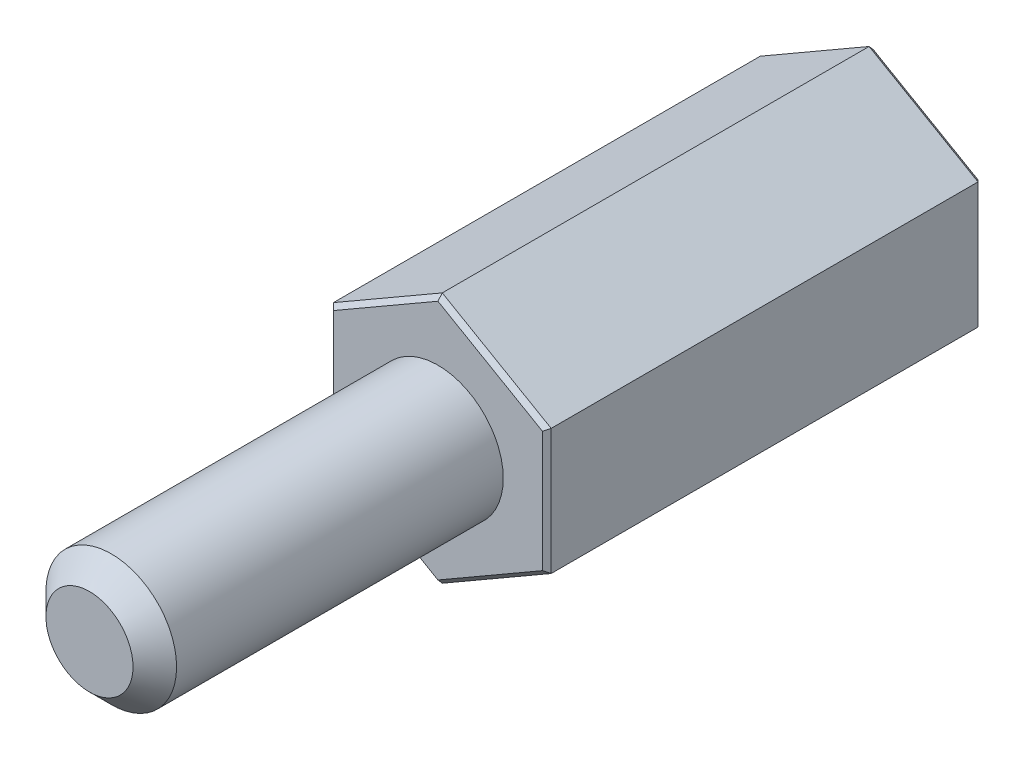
ISO-10303-21;
HEADER;
FILE_DESCRIPTION(('STEP AP214'),'2;1');
FILE_NAME('part.step','',(''),(''),'','','');
FILE_SCHEMA(('AUTOMOTIVE_DESIGN { 1 0 10303 214 1 1 1 1 }'));
ENDSEC;
DATA;
#1=APPLICATION_CONTEXT('core data for automotive mechanical design processes');
#2=APPLICATION_PROTOCOL_DEFINITION('international standard','automotive_design',2000,#1);
#3=PRODUCT_CONTEXT('',#1,'mechanical');
#4=PRODUCT('Part','Part','',(#3));
#5=PRODUCT_RELATED_PRODUCT_CATEGORY('part','',(#4));
#6=PRODUCT_DEFINITION_FORMATION('','',#4);
#7=PRODUCT_DEFINITION_CONTEXT('part definition',#1,'design');
#8=PRODUCT_DEFINITION('design','',#6,#7);
#9=PRODUCT_DEFINITION_SHAPE('','',#8);
#10=(LENGTH_UNIT() NAMED_UNIT(*) SI_UNIT(.MILLI.,.METRE.));
#11=(NAMED_UNIT(*) PLANE_ANGLE_UNIT() SI_UNIT($,.RADIAN.));
#12=(NAMED_UNIT(*) SI_UNIT($,.STERADIAN.) SOLID_ANGLE_UNIT());
#13=UNCERTAINTY_MEASURE_WITH_UNIT(LENGTH_MEASURE(1.E-05),#10,'distance_accuracy_value','');
#14=(GEOMETRIC_REPRESENTATION_CONTEXT(3) GLOBAL_UNCERTAINTY_ASSIGNED_CONTEXT((#13)) GLOBAL_UNIT_ASSIGNED_CONTEXT((#10,
#11,#12)) REPRESENTATION_CONTEXT('',''));
#15=CARTESIAN_POINT('',(0.,0.,0.));
#16=DIRECTION('',(0.,0.,1.));
#17=DIRECTION('',(1.,0.,0.));
#18=AXIS2_PLACEMENT_3D('',#15,#16,#17);
#19=CARTESIAN_POINT('',(2.5,1.44337567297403,10.));
#20=DIRECTION('',(0.,0.,1.));
#21=DIRECTION('',(1.,0.,0.));
#22=AXIS2_PLACEMENT_3D('',#19,#20,#21);
#23=PLANE('',#22);
#24=DIRECTION('',(-0.866025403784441,-0.499999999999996,0.));
#25=VECTOR('',#24,1.);
#26=CARTESIAN_POINT('',(-2.44999999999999,1.3567731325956,10.));
#27=LINE('',#26,#25);
#28=CARTESIAN_POINT('',(0.,2.77128129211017,10.));
#29=VERTEX_POINT('',#28);
#30=CARTESIAN_POINT('',(-2.39999999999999,1.38564064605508,10.));
#31=VERTEX_POINT('',#30);
#32=EDGE_CURVE('E268',#29,#31,#27,.T.);
#33=ORIENTED_EDGE('',*,*,#32,.T.);
#34=DIRECTION('',(0.,-1.,0.));
#35=VECTOR('',#34,1.);
#36=CARTESIAN_POINT('',(-2.40000000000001,-1.44337567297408,10.));
#37=LINE('',#36,#35);
#38=CARTESIAN_POINT('',(-2.40000000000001,-1.38564064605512,10.));
#39=VERTEX_POINT('',#38);
#40=EDGE_CURVE('E47',#31,#39,#37,.T.);
#41=ORIENTED_EDGE('',*,*,#40,.T.);
#42=DIRECTION('',(0.866025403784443,-0.499999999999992,0.));
#43=VECTOR('',#42,1.);
#44=CARTESIAN_POINT('',(0.0500000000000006,-2.80014880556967,10.));
#45=LINE('',#44,#43);
#46=CARTESIAN_POINT('',(0.,-2.77128129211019,10.));
#47=VERTEX_POINT('',#46);
#48=EDGE_CURVE('E272',#39,#47,#45,.T.);
#49=ORIENTED_EDGE('',*,*,#48,.T.);
#50=DIRECTION('',(0.866025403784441,0.499999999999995,0.));
#51=VECTOR('',#50,1.);
#52=CARTESIAN_POINT('',(2.45,-1.35677313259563,10.));
#53=LINE('',#52,#51);
#54=CARTESIAN_POINT('',(2.4,-1.38564064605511,10.));
#55=VERTEX_POINT('',#54);
#56=EDGE_CURVE('E270',#47,#55,#53,.T.);
#57=ORIENTED_EDGE('',*,*,#56,.T.);
#58=DIRECTION('',(0.,1.,0.));
#59=VECTOR('',#58,1.);
#60=CARTESIAN_POINT('',(2.4,1.44337567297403,10.));
#61=LINE('',#60,#59);
#62=CARTESIAN_POINT('',(2.4,1.38564064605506,10.));
#63=VERTEX_POINT('',#62);
#64=EDGE_CURVE('E237',#55,#63,#61,.T.);
#65=ORIENTED_EDGE('',*,*,#64,.T.);
#66=DIRECTION('',(-0.866025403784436,0.500000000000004,0.));
#67=VECTOR('',#66,1.);
#68=CARTESIAN_POINT('',(-0.0499999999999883,2.80014880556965,10.));
#69=LINE('',#68,#67);
#70=EDGE_CURVE('E266',#63,#29,#69,.T.);
#71=ORIENTED_EDGE('',*,*,#70,.T.);
#72=EDGE_LOOP('',(#33,#41,#49,#57,#65,#71));
#73=FACE_BOUND('',#72,.T.);
#74=CARTESIAN_POINT('',(0.,0.,10.));
#75=DIRECTION('',(0.,0.,1.));
#76=DIRECTION('',(1.,0.,0.));
#77=AXIS2_PLACEMENT_3D('',#74,#75,#76);
#78=CIRCLE('',#77,1.5);
#79=CARTESIAN_POINT('',(1.5,0.,10.));
#80=VERTEX_POINT('',#79);
#81=EDGE_CURVE('E292',#80,#80,#78,.T.);
#82=ORIENTED_EDGE('',*,*,#81,.F.);
#83=EDGE_LOOP('',(#82));
#84=FACE_BOUND('',#83,.T.);
#85=ADVANCED_FACE('F38',(#73,#84),#23,.T.);
#86=CARTESIAN_POINT('',(0.,2.8867513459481,10.));
#87=DIRECTION('',(-0.500000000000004,-0.866025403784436,0.));
#88=DIRECTION('',(0.866025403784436,-0.500000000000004,0.));
#89=AXIS2_PLACEMENT_3D('',#86,#87,#88);
#90=PLANE('',#89);
#91=DIRECTION('',(0.,0.,-1.));
#92=VECTOR('',#91,1.);
#93=CARTESIAN_POINT('',(2.5,1.44337567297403,10.));
#94=LINE('',#93,#92);
#95=CARTESIAN_POINT('',(2.5,1.44337567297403,9.9));
#96=VERTEX_POINT('',#95);
#97=CARTESIAN_POINT('',(2.5,1.44337567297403,0.100000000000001));
#98=VERTEX_POINT('',#97);
#99=EDGE_CURVE('E347',#96,#98,#94,.T.);
#100=ORIENTED_EDGE('',*,*,#99,.T.);
#101=DIRECTION('',(-0.866025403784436,0.500000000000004,0.));
#102=VECTOR('',#101,1.);
#103=CARTESIAN_POINT('',(0.,2.8867513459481,0.100000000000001));
#104=LINE('',#103,#102);
#105=CARTESIAN_POINT('',(0.,2.8867513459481,0.100000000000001));
#106=VERTEX_POINT('',#105);
#107=EDGE_CURVE('E260',#98,#106,#104,.T.);
#108=ORIENTED_EDGE('',*,*,#107,.T.);
#109=DIRECTION('',(0.,0.,-1.));
#110=VECTOR('',#109,1.);
#111=CARTESIAN_POINT('',(0.,2.8867513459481,10.));
#112=LINE('',#111,#110);
#113=CARTESIAN_POINT('',(0.,2.8867513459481,9.9));
#114=VERTEX_POINT('',#113);
#115=EDGE_CURVE('E334',#114,#106,#112,.T.);
#116=ORIENTED_EDGE('',*,*,#115,.F.);
#117=DIRECTION('',(0.866025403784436,-0.500000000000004,0.));
#118=VECTOR('',#117,1.);
#119=CARTESIAN_POINT('',(2.5,1.44337567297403,9.9));
#120=LINE('',#119,#118);
#121=EDGE_CURVE('E253',#114,#96,#120,.T.);
#122=ORIENTED_EDGE('',*,*,#121,.T.);
#123=EDGE_LOOP('',(#100,#108,#116,#122));
#124=FACE_BOUND('',#123,.T.);
#125=ADVANCED_FACE('F140',(#124),#90,.F.);
#126=CARTESIAN_POINT('',(0.,2.8867513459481,10.));
#127=DIRECTION('',(0.499999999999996,-0.866025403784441,0.));
#128=DIRECTION('',(0.866025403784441,0.499999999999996,0.));
#129=AXIS2_PLACEMENT_3D('',#126,#127,#128);
#130=PLANE('',#129);
#131=ORIENTED_EDGE('',*,*,#115,.T.);
#132=DIRECTION('',(-0.866025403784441,-0.499999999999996,0.));
#133=VECTOR('',#132,1.);
#134=CARTESIAN_POINT('',(0.,2.8867513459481,0.100000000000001));
#135=LINE('',#134,#133);
#136=CARTESIAN_POINT('',(-2.49999999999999,1.44337567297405,0.100000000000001));
#137=VERTEX_POINT('',#136);
#138=EDGE_CURVE('E323',#106,#137,#135,.T.);
#139=ORIENTED_EDGE('',*,*,#138,.T.);
#140=DIRECTION('',(0.,0.,-1.));
#141=VECTOR('',#140,1.);
#142=CARTESIAN_POINT('',(-2.49999999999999,1.44337567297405,10.));
#143=LINE('',#142,#141);
#144=CARTESIAN_POINT('',(-2.49999999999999,1.44337567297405,9.9));
#145=VERTEX_POINT('',#144);
#146=EDGE_CURVE('E337',#145,#137,#143,.T.);
#147=ORIENTED_EDGE('',*,*,#146,.F.);
#148=DIRECTION('',(0.866025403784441,0.499999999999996,0.));
#149=VECTOR('',#148,1.);
#150=CARTESIAN_POINT('',(0.,2.8867513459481,9.9));
#151=LINE('',#150,#149);
#152=EDGE_CURVE('E326',#145,#114,#151,.T.);
#153=ORIENTED_EDGE('',*,*,#152,.T.);
#154=EDGE_LOOP('',(#131,#139,#147,#153));
#155=FACE_BOUND('',#154,.T.);
#156=ADVANCED_FACE('F146',(#155),#130,.F.);
#157=CARTESIAN_POINT('',(-2.50000000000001,-1.44337567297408,10.));
#158=DIRECTION('',(1.,0.,0.));
#159=DIRECTION('',(0.,1.,0.));
#160=AXIS2_PLACEMENT_3D('',#157,#158,#159);
#161=PLANE('',#160);
#162=ORIENTED_EDGE('',*,*,#146,.T.);
#163=DIRECTION('',(0.,-1.,0.));
#164=VECTOR('',#163,1.);
#165=CARTESIAN_POINT('',(-2.50000000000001,-1.44337567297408,0.100000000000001));
#166=LINE('',#165,#164);
#167=CARTESIAN_POINT('',(-2.50000000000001,-1.44337567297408,0.100000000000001));
#168=VERTEX_POINT('',#167);
#169=EDGE_CURVE('E304',#137,#168,#166,.T.);
#170=ORIENTED_EDGE('',*,*,#169,.T.);
#171=DIRECTION('',(0.,0.,-1.));
#172=VECTOR('',#171,1.);
#173=CARTESIAN_POINT('',(-2.50000000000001,-1.44337567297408,10.));
#174=LINE('',#173,#172);
#175=CARTESIAN_POINT('',(-2.50000000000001,-1.44337567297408,9.9));
#176=VERTEX_POINT('',#175);
#177=EDGE_CURVE('E340',#176,#168,#174,.T.);
#178=ORIENTED_EDGE('',*,*,#177,.F.);
#179=DIRECTION('',(0.,1.,0.));
#180=VECTOR('',#179,1.);
#181=CARTESIAN_POINT('',(-2.49999999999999,1.44337567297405,9.9));
#182=LINE('',#181,#180);
#183=EDGE_CURVE('E305',#176,#145,#182,.T.);
#184=ORIENTED_EDGE('',*,*,#183,.T.);
#185=EDGE_LOOP('',(#162,#170,#178,#184));
#186=FACE_BOUND('',#185,.T.);
#187=ADVANCED_FACE('F169',(#186),#161,.F.);
#188=CARTESIAN_POINT('',(0.,-2.88675134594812,10.));
#189=DIRECTION('',(0.499999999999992,0.866025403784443,0.));
#190=DIRECTION('',(-0.866025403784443,0.499999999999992,0.));
#191=AXIS2_PLACEMENT_3D('',#188,#189,#190);
#192=PLANE('',#191);
#193=ORIENTED_EDGE('',*,*,#177,.T.);
#194=DIRECTION('',(0.866025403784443,-0.499999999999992,0.));
#195=VECTOR('',#194,1.);
#196=CARTESIAN_POINT('',(0.,-2.88675134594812,0.100000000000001));
#197=LINE('',#196,#195);
#198=CARTESIAN_POINT('',(0.,-2.88675134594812,0.100000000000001));
#199=VERTEX_POINT('',#198);
#200=EDGE_CURVE('E251',#168,#199,#197,.T.);
#201=ORIENTED_EDGE('',*,*,#200,.T.);
#202=DIRECTION('',(0.,0.,-1.));
#203=VECTOR('',#202,1.);
#204=CARTESIAN_POINT('',(0.,-2.88675134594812,10.));
#205=LINE('',#204,#203);
#206=CARTESIAN_POINT('',(0.,-2.88675134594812,9.9));
#207=VERTEX_POINT('',#206);
#208=EDGE_CURVE('E342',#207,#199,#205,.T.);
#209=ORIENTED_EDGE('',*,*,#208,.F.);
#210=DIRECTION('',(-0.866025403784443,0.499999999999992,0.));
#211=VECTOR('',#210,1.);
#212=CARTESIAN_POINT('',(-2.50000000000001,-1.44337567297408,9.9));
#213=LINE('',#212,#211);
#214=EDGE_CURVE('E255',#207,#176,#213,.T.);
#215=ORIENTED_EDGE('',*,*,#214,.T.);
#216=EDGE_LOOP('',(#193,#201,#209,#215));
#217=FACE_BOUND('',#216,.T.);
#218=ADVANCED_FACE('F165',(#217),#192,.F.);
#219=CARTESIAN_POINT('',(0.,-2.88675134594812,10.));
#220=DIRECTION('',(-0.499999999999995,0.866025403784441,0.));
#221=DIRECTION('',(-0.866025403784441,-0.499999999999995,0.));
#222=AXIS2_PLACEMENT_3D('',#219,#220,#221);
#223=PLANE('',#222);
#224=ORIENTED_EDGE('',*,*,#208,.T.);
#225=DIRECTION('',(0.866025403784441,0.499999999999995,0.));
#226=VECTOR('',#225,1.);
#227=CARTESIAN_POINT('',(0.,-2.88675134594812,0.100000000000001));
#228=LINE('',#227,#226);
#229=CARTESIAN_POINT('',(2.5,-1.44337567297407,0.100000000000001));
#230=VERTEX_POINT('',#229);
#231=EDGE_CURVE('E250',#199,#230,#228,.T.);
#232=ORIENTED_EDGE('',*,*,#231,.T.);
#233=DIRECTION('',(0.,0.,-1.));
#234=VECTOR('',#233,1.);
#235=CARTESIAN_POINT('',(2.5,-1.44337567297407,10.));
#236=LINE('',#235,#234);
#237=CARTESIAN_POINT('',(2.5,-1.44337567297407,9.9));
#238=VERTEX_POINT('',#237);
#239=EDGE_CURVE('E344',#238,#230,#236,.T.);
#240=ORIENTED_EDGE('',*,*,#239,.F.);
#241=DIRECTION('',(-0.866025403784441,-0.499999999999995,0.));
#242=VECTOR('',#241,1.);
#243=CARTESIAN_POINT('',(0.,-2.88675134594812,9.9));
#244=LINE('',#243,#242);
#245=EDGE_CURVE('E243',#238,#207,#244,.T.);
#246=ORIENTED_EDGE('',*,*,#245,.T.);
#247=EDGE_LOOP('',(#224,#232,#240,#246));
#248=FACE_BOUND('',#247,.T.);
#249=ADVANCED_FACE('F161',(#248),#223,.F.);
#250=CARTESIAN_POINT('',(2.5,-1.44337567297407,10.));
#251=DIRECTION('',(-1.,0.,0.));
#252=DIRECTION('',(0.,0.,1.));
#253=AXIS2_PLACEMENT_3D('',#250,#251,#252);
#254=PLANE('',#253);
#255=ORIENTED_EDGE('',*,*,#239,.T.);
#256=DIRECTION('',(0.,1.,0.));
#257=VECTOR('',#256,1.);
#258=CARTESIAN_POINT('',(2.5,-1.44337567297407,0.100000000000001));
#259=LINE('',#258,#257);
#260=EDGE_CURVE('E263',#230,#98,#259,.T.);
#261=ORIENTED_EDGE('',*,*,#260,.T.);
#262=ORIENTED_EDGE('',*,*,#99,.F.);
#263=DIRECTION('',(0.,-1.,0.));
#264=VECTOR('',#263,1.);
#265=CARTESIAN_POINT('',(2.5,-1.44337567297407,9.9));
#266=LINE('',#265,#264);
#267=EDGE_CURVE('E235',#96,#238,#266,.T.);
#268=ORIENTED_EDGE('',*,*,#267,.T.);
#269=EDGE_LOOP('',(#255,#261,#262,#268));
#270=FACE_BOUND('',#269,.T.);
#271=ADVANCED_FACE('F157',(#270),#254,.F.);
#272=CARTESIAN_POINT('',(2.5,1.44337567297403,0.));
#273=DIRECTION('',(0.,0.,1.));
#274=DIRECTION('',(1.,0.,0.));
#275=AXIS2_PLACEMENT_3D('',#272,#273,#274);
#276=PLANE('',#275);
#277=CARTESIAN_POINT('',(0.,0.,0.));
#278=DIRECTION('',(0.,0.,-1.));
#279=DIRECTION('',(-1.,0.,0.));
#280=AXIS2_PLACEMENT_3D('',#277,#278,#279);
#281=CIRCLE('',#280,1.25);
#282=CARTESIAN_POINT('',(-1.25,0.,0.));
#283=VERTEX_POINT('',#282);
#284=EDGE_CURVE('E294',#283,#283,#281,.T.);
#285=ORIENTED_EDGE('',*,*,#284,.F.);
#286=EDGE_LOOP('',(#285));
#287=FACE_BOUND('',#286,.T.);
#288=DIRECTION('',(0.,1.,0.));
#289=VECTOR('',#288,1.);
#290=CARTESIAN_POINT('',(-2.4,1.44337567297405,0.));
#291=LINE('',#290,#289);
#292=CARTESIAN_POINT('',(-2.40000000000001,-1.38564064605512,0.));
#293=VERTEX_POINT('',#292);
#294=CARTESIAN_POINT('',(-2.4,1.38564064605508,0.));
#295=VERTEX_POINT('',#294);
#296=EDGE_CURVE('E313',#293,#295,#291,.T.);
#297=ORIENTED_EDGE('',*,*,#296,.T.);
#298=DIRECTION('',(0.866025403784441,0.499999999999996,0.));
#299=VECTOR('',#298,1.);
#300=CARTESIAN_POINT('',(1.30000000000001,3.52183664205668,0.));
#301=LINE('',#300,#299);
#302=CARTESIAN_POINT('',(0.,2.77128129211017,0.));
#303=VERTEX_POINT('',#302);
#304=EDGE_CURVE('E310',#295,#303,#301,.T.);
#305=ORIENTED_EDGE('',*,*,#304,.T.);
#306=DIRECTION('',(0.866025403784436,-0.500000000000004,0.));
#307=VECTOR('',#306,1.);
#308=CARTESIAN_POINT('',(2.45,1.35677313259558,0.));
#309=LINE('',#308,#307);
#310=CARTESIAN_POINT('',(2.4,1.38564064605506,0.));
#311=VERTEX_POINT('',#310);
#312=EDGE_CURVE('E319',#303,#311,#309,.T.);
#313=ORIENTED_EDGE('',*,*,#312,.T.);
#314=DIRECTION('',(0.,-1.,0.));
#315=VECTOR('',#314,1.);
#316=CARTESIAN_POINT('',(2.4,1.44337567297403,0.));
#317=LINE('',#316,#315);
#318=CARTESIAN_POINT('',(2.4,-1.38564064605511,0.));
#319=VERTEX_POINT('',#318);
#320=EDGE_CURVE('E321',#311,#319,#317,.T.);
#321=ORIENTED_EDGE('',*,*,#320,.T.);
#322=DIRECTION('',(-0.866025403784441,-0.499999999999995,0.));
#323=VECTOR('',#322,1.);
#324=CARTESIAN_POINT('',(3.69999999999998,-0.635085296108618,0.));
#325=LINE('',#324,#323);
#326=CARTESIAN_POINT('',(0.,-2.77128129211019,0.));
#327=VERTEX_POINT('',#326);
#328=EDGE_CURVE('E317',#319,#327,#325,.T.);
#329=ORIENTED_EDGE('',*,*,#328,.T.);
#330=DIRECTION('',(-0.866025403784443,0.499999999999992,0.));
#331=VECTOR('',#330,1.);
#332=CARTESIAN_POINT('',(0.0500000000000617,-2.80014880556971,0.));
#333=LINE('',#332,#331);
#334=EDGE_CURVE('E315',#327,#293,#333,.T.);
#335=ORIENTED_EDGE('',*,*,#334,.T.);
#336=EDGE_LOOP('',(#297,#305,#313,#321,#329,#335));
#337=FACE_BOUND('',#336,.T.);
#338=ADVANCED_FACE('F154',(#287,#337),#276,.F.);
#339=CARTESIAN_POINT('',(0.,0.,18.));
#340=DIRECTION('',(0.,0.,-1.));
#341=DIRECTION('',(-1.,0.,0.));
#342=AXIS2_PLACEMENT_3D('',#339,#340,#341);
#343=CYLINDRICAL_SURFACE('',#342,1.5);
#344=CARTESIAN_POINT('',(0.,0.,17.5));
#345=DIRECTION('',(0.,0.,1.));
#346=DIRECTION('',(1.,0.,0.));
#347=AXIS2_PLACEMENT_3D('',#344,#345,#346);
#348=CIRCLE('',#347,1.5);
#349=CARTESIAN_POINT('',(1.5,0.,17.5));
#350=VERTEX_POINT('',#349);
#351=EDGE_CURVE('E328',#350,#350,#348,.F.);
#352=ORIENTED_EDGE('',*,*,#351,.T.);
#353=EDGE_LOOP('',(#352));
#354=FACE_BOUND('',#353,.T.);
#355=ORIENTED_EDGE('',*,*,#81,.T.);
#356=EDGE_LOOP('',(#355));
#357=FACE_BOUND('',#356,.T.);
#358=ADVANCED_FACE('F152',(#354,#357),#343,.T.);
#359=CARTESIAN_POINT('',(0.,0.,18.));
#360=DIRECTION('',(0.,0.,1.));
#361=DIRECTION('',(1.,0.,0.));
#362=AXIS2_PLACEMENT_3D('',#359,#360,#361);
#363=PLANE('',#362);
#364=CARTESIAN_POINT('',(0.,0.,18.));
#365=DIRECTION('',(0.,0.,1.));
#366=DIRECTION('',(1.,0.,0.));
#367=AXIS2_PLACEMENT_3D('',#364,#365,#366);
#368=CIRCLE('',#367,0.999999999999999);
#369=CARTESIAN_POINT('',(0.999999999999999,0.,18.));
#370=VERTEX_POINT('',#369);
#371=EDGE_CURVE('E331',#370,#370,#368,.T.);
#372=ORIENTED_EDGE('',*,*,#371,.T.);
#373=EDGE_LOOP('',(#372));
#374=FACE_BOUND('',#373,.T.);
#375=ADVANCED_FACE('F181',(#374),#363,.T.);
#376=CARTESIAN_POINT('',(0.,0.,18.));
#377=DIRECTION('',(0.,0.,-1.));
#378=DIRECTION('',(-1.,0.,0.));
#379=AXIS2_PLACEMENT_3D('',#376,#377,#378);
#380=CONICAL_SURFACE('',#379,0.999999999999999,0.785398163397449);
#381=ORIENTED_EDGE('',*,*,#351,.F.);
#382=EDGE_LOOP('',(#381));
#383=FACE_BOUND('',#382,.T.);
#384=ORIENTED_EDGE('',*,*,#371,.F.);
#385=EDGE_LOOP('',(#384));
#386=FACE_BOUND('',#385,.T.);
#387=ADVANCED_FACE('F177',(#383,#386),#380,.T.);
#388=CARTESIAN_POINT('',(0.,-2.88675134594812,0.100000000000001));
#389=DIRECTION('',(-0.353553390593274,0.612372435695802,0.707106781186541));
#390=DIRECTION('',(0.,-0.755928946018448,0.654653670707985));
#391=AXIS2_PLACEMENT_3D('',#388,#389,#390);
#392=PLANE('',#391);
#393=DIRECTION('',(0.,0.755928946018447,-0.654653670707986));
#394=VECTOR('',#393,1.);
#395=CARTESIAN_POINT('',(0.,-2.88675134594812,0.100000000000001));
#396=LINE('',#395,#394);
#397=EDGE_CURVE('E286',#327,#199,#396,.F.);
#398=ORIENTED_EDGE('',*,*,#397,.F.);
#399=ORIENTED_EDGE('',*,*,#328,.F.);
#400=DIRECTION('',(-0.654653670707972,0.377964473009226,-0.654653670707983));
#401=VECTOR('',#400,1.);
#402=CARTESIAN_POINT('',(2.5,-1.44337567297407,0.100000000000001));
#403=LINE('',#402,#401);
#404=EDGE_CURVE('E289',#230,#319,#403,.T.);
#405=ORIENTED_EDGE('',*,*,#404,.F.);
#406=ORIENTED_EDGE('',*,*,#231,.F.);
#407=EDGE_LOOP('',(#398,#399,#405,#406));
#408=FACE_BOUND('',#407,.T.);
#409=ADVANCED_FACE('F180',(#408),#392,.F.);
#410=CARTESIAN_POINT('',(2.5,-1.44337567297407,0.100000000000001));
#411=DIRECTION('',(-0.707106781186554,0.,0.707106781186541));
#412=DIRECTION('',(0.707106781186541,0.,0.707106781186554));
#413=AXIS2_PLACEMENT_3D('',#410,#411,#412);
#414=PLANE('',#413);
#415=ORIENTED_EDGE('',*,*,#404,.T.);
#416=ORIENTED_EDGE('',*,*,#320,.F.);
#417=DIRECTION('',(0.654653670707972,0.377964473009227,0.654653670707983));
#418=VECTOR('',#417,1.);
#419=CARTESIAN_POINT('',(1.7857142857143,1.03098262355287,-0.614285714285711));
#420=LINE('',#419,#418);
#421=EDGE_CURVE('E283',#98,#311,#420,.F.);
#422=ORIENTED_EDGE('',*,*,#421,.F.);
#423=ORIENTED_EDGE('',*,*,#260,.F.);
#424=EDGE_LOOP('',(#415,#416,#422,#423));
#425=FACE_BOUND('',#424,.T.);
#426=ADVANCED_FACE('F199',(#425),#414,.F.);
#427=CARTESIAN_POINT('',(0.,-2.88675134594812,0.100000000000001));
#428=DIRECTION('',(0.353553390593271,0.612372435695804,0.707106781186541));
#429=DIRECTION('',(0.,-0.755928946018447,0.654653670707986));
#430=AXIS2_PLACEMENT_3D('',#427,#428,#429);
#431=PLANE('',#430);
#432=ORIENTED_EDGE('',*,*,#397,.T.);
#433=ORIENTED_EDGE('',*,*,#200,.F.);
#434=DIRECTION('',(0.654653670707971,0.377964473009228,-0.654653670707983));
#435=VECTOR('',#434,1.);
#436=CARTESIAN_POINT('',(-1.7857142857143,-1.03098262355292,-0.614285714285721));
#437=LINE('',#436,#435);
#438=EDGE_CURVE('E280',#293,#168,#437,.F.);
#439=ORIENTED_EDGE('',*,*,#438,.F.);
#440=ORIENTED_EDGE('',*,*,#334,.F.);
#441=EDGE_LOOP('',(#432,#433,#439,#440));
#442=FACE_BOUND('',#441,.T.);
#443=ADVANCED_FACE('F195',(#442),#431,.F.);
#444=CARTESIAN_POINT('',(0.,2.8867513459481,0.100000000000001));
#445=DIRECTION('',(-0.353553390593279,-0.612372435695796,0.707106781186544));
#446=DIRECTION('',(0.,-0.755928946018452,-0.65465367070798));
#447=AXIS2_PLACEMENT_3D('',#444,#445,#446);
#448=PLANE('',#447);
#449=ORIENTED_EDGE('',*,*,#421,.T.);
#450=ORIENTED_EDGE('',*,*,#312,.F.);
#451=DIRECTION('',(0.,0.75592894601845,0.654653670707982));
#452=VECTOR('',#451,1.);
#453=CARTESIAN_POINT('',(0.,2.8867513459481,0.100000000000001));
#454=LINE('',#453,#452);
#455=EDGE_CURVE('E278',#106,#303,#454,.F.);
#456=ORIENTED_EDGE('',*,*,#455,.F.);
#457=ORIENTED_EDGE('',*,*,#107,.F.);
#458=EDGE_LOOP('',(#449,#450,#456,#457));
#459=FACE_BOUND('',#458,.T.);
#460=ADVANCED_FACE('F191',(#459),#448,.F.);
#461=CARTESIAN_POINT('',(-2.50000000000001,-1.44337567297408,0.100000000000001));
#462=DIRECTION('',(0.707106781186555,0.,0.70710678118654));
#463=DIRECTION('',(0.70710678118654,0.,-0.707106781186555));
#464=AXIS2_PLACEMENT_3D('',#461,#462,#463);
#465=PLANE('',#464);
#466=ORIENTED_EDGE('',*,*,#438,.T.);
#467=ORIENTED_EDGE('',*,*,#169,.F.);
#468=DIRECTION('',(0.654653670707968,-0.377964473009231,-0.654653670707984));
#469=VECTOR('',#468,1.);
#470=CARTESIAN_POINT('',(-1.78571428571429,1.03098262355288,-0.61428571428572));
#471=LINE('',#470,#469);
#472=EDGE_CURVE('E276',#295,#137,#471,.F.);
#473=ORIENTED_EDGE('',*,*,#472,.F.);
#474=ORIENTED_EDGE('',*,*,#296,.F.);
#475=EDGE_LOOP('',(#466,#467,#473,#474));
#476=FACE_BOUND('',#475,.T.);
#477=ADVANCED_FACE('F187',(#476),#465,.F.);
#478=CARTESIAN_POINT('',(0.,2.8867513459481,0.100000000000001));
#479=DIRECTION('',(0.353553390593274,-0.612372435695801,0.707106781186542));
#480=DIRECTION('',(0.,-0.755928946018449,-0.654653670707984));
#481=AXIS2_PLACEMENT_3D('',#478,#479,#480);
#482=PLANE('',#481);
#483=ORIENTED_EDGE('',*,*,#455,.T.);
#484=ORIENTED_EDGE('',*,*,#304,.F.);
#485=ORIENTED_EDGE('',*,*,#472,.T.);
#486=ORIENTED_EDGE('',*,*,#138,.F.);
#487=EDGE_LOOP('',(#483,#484,#485,#486));
#488=FACE_BOUND('',#487,.T.);
#489=ADVANCED_FACE('F183',(#488),#482,.F.);
#490=CARTESIAN_POINT('',(2.4,1.44337567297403,10.));
#491=DIRECTION('',(0.707106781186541,0.,0.707106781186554));
#492=DIRECTION('',(0.707106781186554,0.,-0.707106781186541));
#493=AXIS2_PLACEMENT_3D('',#490,#491,#492);
#494=PLANE('',#493);
#495=DIRECTION('',(0.654653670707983,-0.377964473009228,-0.654653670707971));
#496=VECTOR('',#495,1.);
#497=CARTESIAN_POINT('',(1.7,-0.981495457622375,10.7));
#498=LINE('',#497,#496);
#499=EDGE_CURVE('E232',#238,#55,#498,.F.);
#500=ORIENTED_EDGE('',*,*,#499,.F.);
#501=ORIENTED_EDGE('',*,*,#267,.F.);
#502=DIRECTION('',(-0.654653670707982,-0.37796447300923,0.654653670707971));
#503=VECTOR('',#502,1.);
#504=CARTESIAN_POINT('',(2.41428571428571,1.39388850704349,9.98571428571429));
#505=LINE('',#504,#503);
#506=EDGE_CURVE('E239',#63,#96,#505,.F.);
#507=ORIENTED_EDGE('',*,*,#506,.F.);
#508=ORIENTED_EDGE('',*,*,#64,.F.);
#509=EDGE_LOOP('',(#500,#501,#507,#508));
#510=FACE_BOUND('',#509,.T.);
#511=ADVANCED_FACE('F186',(#510),#494,.T.);
#512=CARTESIAN_POINT('',(2.45,1.35677313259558,10.));
#513=DIRECTION('',(0.353553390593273,0.612372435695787,0.707106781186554));
#514=DIRECTION('',(0.,-0.755928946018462,0.654653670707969));
#515=AXIS2_PLACEMENT_3D('',#512,#513,#514);
#516=PLANE('',#515);
#517=ORIENTED_EDGE('',*,*,#506,.T.);
#518=ORIENTED_EDGE('',*,*,#121,.F.);
#519=DIRECTION('',(0.,-0.75592894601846,0.65465367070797));
#520=VECTOR('',#519,1.);
#521=CARTESIAN_POINT('',(0.,1.96299091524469,10.7));
#522=LINE('',#521,#520);
#523=EDGE_CURVE('E240',#29,#114,#522,.F.);
#524=ORIENTED_EDGE('',*,*,#523,.F.);
#525=ORIENTED_EDGE('',*,*,#70,.F.);
#526=EDGE_LOOP('',(#517,#518,#524,#525));
#527=FACE_BOUND('',#526,.T.);
#528=ADVANCED_FACE('F220',(#527),#516,.T.);
#529=CARTESIAN_POINT('',(3.69999999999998,-0.635085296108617,10.));
#530=DIRECTION('',(0.353553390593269,-0.612372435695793,0.707106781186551));
#531=DIRECTION('',(0.,-0.755928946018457,-0.654653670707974));
#532=AXIS2_PLACEMENT_3D('',#529,#530,#531);
#533=PLANE('',#532);
#534=ORIENTED_EDGE('',*,*,#499,.T.);
#535=ORIENTED_EDGE('',*,*,#56,.F.);
#536=DIRECTION('',(0.,-0.755928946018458,-0.654653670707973));
#537=VECTOR('',#536,1.);
#538=CARTESIAN_POINT('',(0.,-1.55059786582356,11.0571428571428));
#539=LINE('',#538,#537);
#540=EDGE_CURVE('E245',#207,#47,#539,.F.);
#541=ORIENTED_EDGE('',*,*,#540,.F.);
#542=ORIENTED_EDGE('',*,*,#245,.F.);
#543=EDGE_LOOP('',(#534,#535,#541,#542));
#544=FACE_BOUND('',#543,.T.);
#545=ADVANCED_FACE('F216',(#544),#533,.T.);
#546=CARTESIAN_POINT('',(1.30000000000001,3.52183664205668,10.));
#547=DIRECTION('',(-0.353553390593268,0.612372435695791,0.707106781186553));
#548=DIRECTION('',(0.,-0.755928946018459,0.654653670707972));
#549=AXIS2_PLACEMENT_3D('',#546,#547,#548);
#550=PLANE('',#549);
#551=ORIENTED_EDGE('',*,*,#523,.T.);
#552=ORIENTED_EDGE('',*,*,#152,.F.);
#553=DIRECTION('',(0.654653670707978,-0.377964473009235,0.654653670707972));
#554=VECTOR('',#553,1.);
#555=CARTESIAN_POINT('',(-1.34285714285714,0.775298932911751,11.0571428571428));
#556=LINE('',#555,#554);
#557=EDGE_CURVE('E125',#31,#145,#556,.F.);
#558=ORIENTED_EDGE('',*,*,#557,.F.);
#559=ORIENTED_EDGE('',*,*,#32,.F.);
#560=EDGE_LOOP('',(#551,#552,#558,#559));
#561=FACE_BOUND('',#560,.T.);
#562=ADVANCED_FACE('F212',(#561),#550,.T.);
#563=CARTESIAN_POINT('',(0.0500000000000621,-2.80014880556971,10.));
#564=DIRECTION('',(-0.353553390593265,-0.612372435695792,0.707106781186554));
#565=DIRECTION('',(0.,-0.755928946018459,-0.654653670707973));
#566=AXIS2_PLACEMENT_3D('',#563,#564,#565);
#567=PLANE('',#566);
#568=ORIENTED_EDGE('',*,*,#540,.T.);
#569=ORIENTED_EDGE('',*,*,#48,.F.);
#570=DIRECTION('',(-0.65465367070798,-0.377964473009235,-0.65465367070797));
#571=VECTOR('',#570,1.);
#572=CARTESIAN_POINT('',(-1.69999999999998,-0.981495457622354,10.7));
#573=LINE('',#572,#571);
#574=EDGE_CURVE('E54',#176,#39,#573,.F.);
#575=ORIENTED_EDGE('',*,*,#574,.F.);
#576=ORIENTED_EDGE('',*,*,#214,.F.);
#577=EDGE_LOOP('',(#568,#569,#575,#576));
#578=FACE_BOUND('',#577,.T.);
#579=ADVANCED_FACE('F209',(#578),#567,.T.);
#580=CARTESIAN_POINT('',(-2.39999999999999,1.44337567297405,10.));
#581=DIRECTION('',(-0.707106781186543,0.,0.707106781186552));
#582=DIRECTION('',(0.707106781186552,0.,0.707106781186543));
#583=AXIS2_PLACEMENT_3D('',#580,#581,#582);
#584=PLANE('',#583);
#585=ORIENTED_EDGE('',*,*,#557,.T.);
#586=ORIENTED_EDGE('',*,*,#183,.F.);
#587=ORIENTED_EDGE('',*,*,#574,.T.);
#588=ORIENTED_EDGE('',*,*,#40,.F.);
#589=EDGE_LOOP('',(#585,#586,#587,#588));
#590=FACE_BOUND('',#589,.T.);
#591=ADVANCED_FACE('F135',(#590),#584,.T.);
#592=CARTESIAN_POINT('',(0.,0.,7.));
#593=DIRECTION('',(0.,0.,-1.));
#594=DIRECTION('',(-1.,0.,0.));
#595=AXIS2_PLACEMENT_3D('',#592,#593,#594);
#596=CYLINDRICAL_SURFACE('',#595,1.25);
#597=CARTESIAN_POINT('',(0.,0.,5.75));
#598=DIRECTION('',(0.,0.,-1.));
#599=DIRECTION('',(-1.,0.,0.));
#600=AXIS2_PLACEMENT_3D('',#597,#598,#599);
#601=CIRCLE('',#600,1.25);
#602=CARTESIAN_POINT('',(-1.25,0.,5.75));
#603=VERTEX_POINT('',#602);
#604=EDGE_CURVE('E11',#603,#603,#601,.F.);
#605=ORIENTED_EDGE('',*,*,#604,.T.);
#606=EDGE_LOOP('',(#605));
#607=FACE_BOUND('',#606,.T.);
#608=ORIENTED_EDGE('',*,*,#284,.T.);
#609=EDGE_LOOP('',(#608));
#610=FACE_BOUND('',#609,.T.);
#611=ADVANCED_FACE('F130',(#607,#610),#596,.F.);
#612=CARTESIAN_POINT('',(0.,0.,5.75));
#613=DIRECTION('',(0.,0.,-1.));
#614=DIRECTION('',(-1.,0.,0.));
#615=AXIS2_PLACEMENT_3D('',#612,#613,#614);
#616=CONICAL_SURFACE('',#615,1.25000000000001,0.785398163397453);
#617=ORIENTED_EDGE('',*,*,#604,.F.);
#618=EDGE_LOOP('',(#617));
#619=FACE_BOUND('',#618,.T.);
#620=CARTESIAN_POINT('',(0.,0.,7.));
#621=VERTEX_POINT('',#620);
#622=VERTEX_LOOP('',#621);
#623=FACE_BOUND('',#622,.T.);
#624=ADVANCED_FACE('F40',(#619,#623),#616,.F.);
#625=CLOSED_SHELL('',(#85,#125,#156,#187,#218,#249,#271,#338,#358,#375,#387,#409,#426,#443,#460,
#477,#489,#511,#528,#545,#562,#579,#591,#611,#624));
#626=MANIFOLD_SOLID_BREP('B2',#625);
#627=ADVANCED_BREP_SHAPE_REPRESENTATION('',(#18,#626),#14);
#628=SHAPE_DEFINITION_REPRESENTATION(#9,#627);
ENDSEC;
END-ISO-10303-21;
